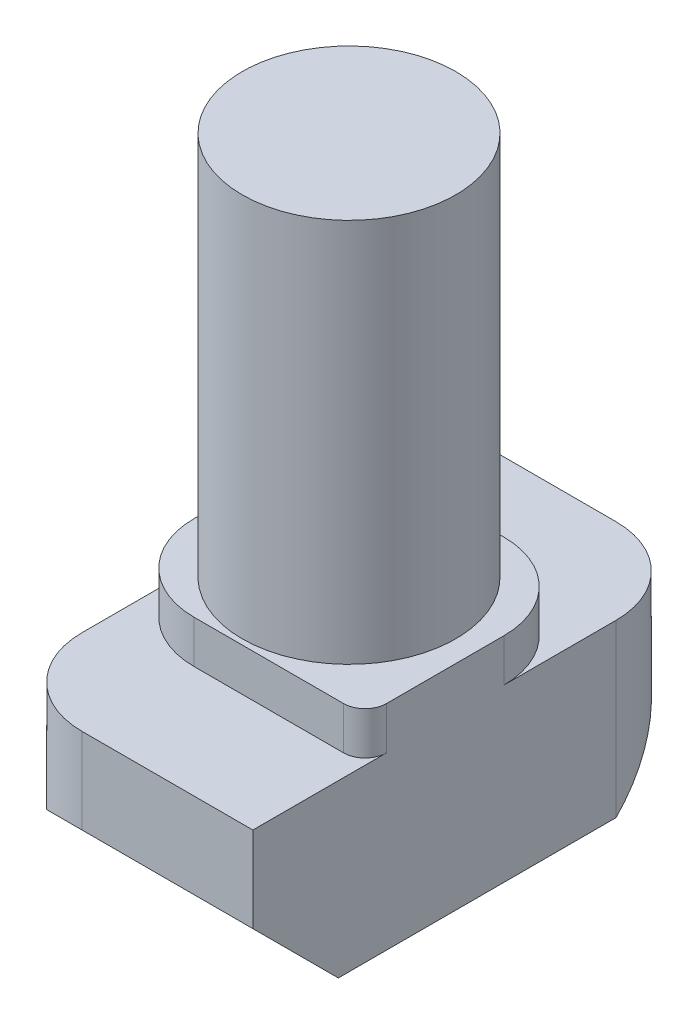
from build123d import *

# Parameters (mm, degrees)
BOSS_EXTRUDE1_DEPTH = 3
FILLET1_R           = 2
FILLET2_R           = 2
FILLET3_R           = 0.5
SKETCH2_W           = 2.5
SKETCH2_H           = 9


with BuildPart() as part:
    # Sketch1 → Boss-Extrude1 (new, symmetric)
    with BuildSketch(Plane(origin=(0, 0, 0), x_dir=(0, 0, -1), z_dir=(1, 0, 0))):
        Polygon((-2.625, 0), (2.625, 0), (2.625, -1), (5.25, -1), (5.25, -3), (3.25, -5), (-3.25, -5), (-5.25, -3), (-5.25, -1), (-2.625, -1), align=None)
    extrude(amount=BOSS_EXTRUDE1_DEPTH, both=True)

    # Fillet1
    fillet1_edges = [part.edges().sort_by_distance(p)[0] for p in [
        (3, -2, -5.25),
        (-3, -2, 5.25),
    ]]
    fillet(fillet1_edges, radius=FILLET1_R)

    # Fillet2
    fillet2_edges = [part.edges().sort_by_distance(p)[0] for p in [
        (-3, -0.5, 2.625),
        (3, -0.5, -2.625),
    ]]
    fillet(fillet2_edges, radius=FILLET2_R)

    # Fillet3
    fillet3_edges = [part.edges().sort_by_distance(p)[0] for p in [
        (3, -0.5, 2.625),
        (-3, -0.5, -2.625),
    ]]
    fillet(fillet3_edges, radius=FILLET3_R)

    # Sketch2 → Revolve1 (revolve)
    with BuildSketch(Plane.XY, mode=Mode.PRIVATE) as revolve1_sk:
        with Locations((1.25, 4.5)):
            Rectangle(SKETCH2_W, SKETCH2_H)
    revolve(revolve1_sk.sketch.rotate(Axis((0, 55, 0), (0, -1, 0)), 90), axis=Axis((0, 55, 0), (0, -1, 0)))


solid = part.part
